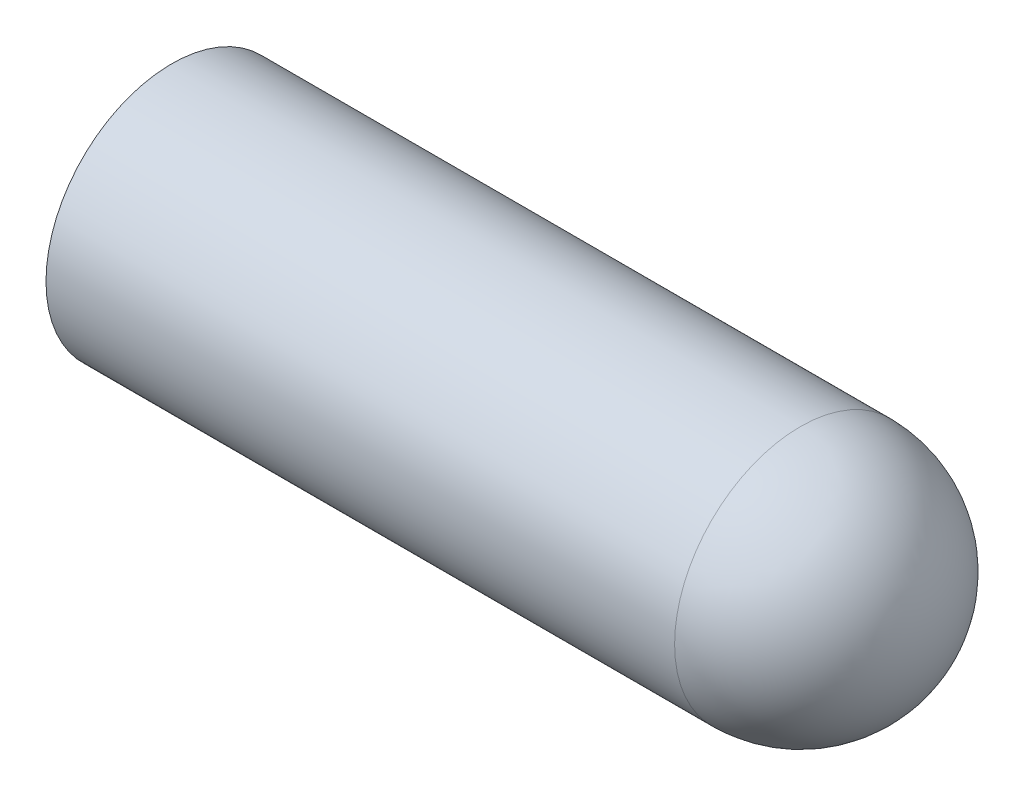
ISO-10303-21;
HEADER;
FILE_DESCRIPTION(('STEP AP214'),'2;1');
FILE_NAME('part.step','',(''),(''),'','','');
FILE_SCHEMA(('AUTOMOTIVE_DESIGN { 1 0 10303 214 1 1 1 1 }'));
ENDSEC;
DATA;
#1=APPLICATION_CONTEXT('core data for automotive mechanical design processes');
#2=APPLICATION_PROTOCOL_DEFINITION('international standard','automotive_design',2000,#1);
#3=PRODUCT_CONTEXT('',#1,'mechanical');
#4=PRODUCT('Part','Part','',(#3));
#5=PRODUCT_RELATED_PRODUCT_CATEGORY('part','',(#4));
#6=PRODUCT_DEFINITION_FORMATION('','',#4);
#7=PRODUCT_DEFINITION_CONTEXT('part definition',#1,'design');
#8=PRODUCT_DEFINITION('design','',#6,#7);
#9=PRODUCT_DEFINITION_SHAPE('','',#8);
#10=(LENGTH_UNIT() NAMED_UNIT(*) SI_UNIT(.MILLI.,.METRE.));
#11=(NAMED_UNIT(*) PLANE_ANGLE_UNIT() SI_UNIT($,.RADIAN.));
#12=(NAMED_UNIT(*) SI_UNIT($,.STERADIAN.) SOLID_ANGLE_UNIT());
#13=UNCERTAINTY_MEASURE_WITH_UNIT(LENGTH_MEASURE(1.E-05),#10,'distance_accuracy_value','');
#14=(GEOMETRIC_REPRESENTATION_CONTEXT(3) GLOBAL_UNCERTAINTY_ASSIGNED_CONTEXT((#13)) GLOBAL_UNIT_ASSIGNED_CONTEXT((#10,
#11,#12)) REPRESENTATION_CONTEXT('',''));
#15=CARTESIAN_POINT('',(0.,0.,0.));
#16=DIRECTION('',(0.,0.,1.));
#17=DIRECTION('',(1.,0.,0.));
#18=AXIS2_PLACEMENT_3D('',#15,#16,#17);
#19=CARTESIAN_POINT('',(0.,0.,0.));
#20=DIRECTION('',(-1.,0.,0.));
#21=DIRECTION('',(0.,1.,0.));
#22=AXIS2_PLACEMENT_3D('',#19,#20,#21);
#23=SPHERICAL_SURFACE('',#22,10.);
#24=CARTESIAN_POINT('',(0.,0.,0.));
#25=DIRECTION('',(-1.,0.,0.));
#26=DIRECTION('',(0.,0.,1.));
#27=AXIS2_PLACEMENT_3D('',#24,#25,#26);
#28=CIRCLE('',#27,10.);
#29=CARTESIAN_POINT('',(0.,0.,10.));
#30=VERTEX_POINT('',#29);
#31=EDGE_CURVE('E10',#30,#30,#28,.T.);
#32=ORIENTED_EDGE('',*,*,#31,.F.);
#33=EDGE_LOOP('',(#32));
#34=FACE_BOUND('',#33,.T.);
#35=ADVANCED_FACE('F32',(#34),#23,.T.);
#36=CARTESIAN_POINT('',(-56.5202521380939,0.,0.));
#37=DIRECTION('',(-1.,0.,0.));
#38=DIRECTION('',(0.,0.,1.));
#39=AXIS2_PLACEMENT_3D('',#36,#37,#38);
#40=CYLINDRICAL_SURFACE('',#39,10.);
#41=CARTESIAN_POINT('',(-50.,0.,0.));
#42=DIRECTION('',(-1.,0.,0.));
#43=DIRECTION('',(0.,0.,1.));
#44=AXIS2_PLACEMENT_3D('',#41,#42,#43);
#45=CIRCLE('',#44,9.99999999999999);
#46=CARTESIAN_POINT('',(-50.,0.,9.99999999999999));
#47=VERTEX_POINT('',#46);
#48=EDGE_CURVE('E38',#47,#47,#45,.T.);
#49=ORIENTED_EDGE('',*,*,#48,.F.);
#50=EDGE_LOOP('',(#49));
#51=FACE_BOUND('',#50,.T.);
#52=ORIENTED_EDGE('',*,*,#31,.T.);
#53=EDGE_LOOP('',(#52));
#54=FACE_BOUND('',#53,.T.);
#55=ADVANCED_FACE('F62',(#51,#54),#40,.T.);
#56=CARTESIAN_POINT('',(-50.,9.99999999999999,0.));
#57=DIRECTION('',(1.,0.,0.));
#58=DIRECTION('',(0.,0.,-1.));
#59=AXIS2_PLACEMENT_3D('',#56,#57,#58);
#60=PLANE('',#59);
#61=CARTESIAN_POINT('',(-50.,0.,0.));
#62=DIRECTION('',(-1.,0.,0.));
#63=DIRECTION('',(0.,0.,1.));
#64=AXIS2_PLACEMENT_3D('',#61,#62,#63);
#65=CIRCLE('',#64,8.8);
#66=CARTESIAN_POINT('',(-50.,0.,8.8));
#67=VERTEX_POINT('',#66);
#68=EDGE_CURVE('E42',#67,#67,#65,.T.);
#69=ORIENTED_EDGE('',*,*,#68,.F.);
#70=EDGE_LOOP('',(#69));
#71=FACE_BOUND('',#70,.T.);
#72=ORIENTED_EDGE('',*,*,#48,.T.);
#73=EDGE_LOOP('',(#72));
#74=FACE_BOUND('',#73,.T.);
#75=ADVANCED_FACE('F57',(#71,#74),#60,.F.);
#76=CARTESIAN_POINT('',(-56.5202521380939,0.,0.));
#77=DIRECTION('',(-1.,0.,0.));
#78=DIRECTION('',(0.,0.,1.));
#79=AXIS2_PLACEMENT_3D('',#76,#77,#78);
#80=CYLINDRICAL_SURFACE('',#79,8.8);
#81=CARTESIAN_POINT('',(0.,0.,0.));
#82=DIRECTION('',(-1.,0.,0.));
#83=DIRECTION('',(0.,0.,1.));
#84=AXIS2_PLACEMENT_3D('',#81,#82,#83);
#85=CIRCLE('',#84,8.8);
#86=CARTESIAN_POINT('',(0.,0.,8.8));
#87=VERTEX_POINT('',#86);
#88=EDGE_CURVE('E46',#87,#87,#85,.T.);
#89=ORIENTED_EDGE('',*,*,#88,.F.);
#90=EDGE_LOOP('',(#89));
#91=FACE_BOUND('',#90,.T.);
#92=ORIENTED_EDGE('',*,*,#68,.T.);
#93=EDGE_LOOP('',(#92));
#94=FACE_BOUND('',#93,.T.);
#95=ADVANCED_FACE('F54',(#91,#94),#80,.F.);
#96=CARTESIAN_POINT('',(0.,0.,0.));
#97=DIRECTION('',(-1.,0.,0.));
#98=DIRECTION('',(0.,1.,0.));
#99=AXIS2_PLACEMENT_3D('',#96,#97,#98);
#100=SPHERICAL_SURFACE('',#99,8.8);
#101=ORIENTED_EDGE('',*,*,#88,.T.);
#102=EDGE_LOOP('',(#101));
#103=FACE_BOUND('',#102,.T.);
#104=ADVANCED_FACE('F52',(#103),#100,.F.);
#105=CLOSED_SHELL('',(#35,#55,#75,#95,#104));
#106=MANIFOLD_SOLID_BREP('B2',#105);
#107=ADVANCED_BREP_SHAPE_REPRESENTATION('',(#18,#106),#14);
#108=SHAPE_DEFINITION_REPRESENTATION(#9,#107);
ENDSEC;
END-ISO-10303-21;
